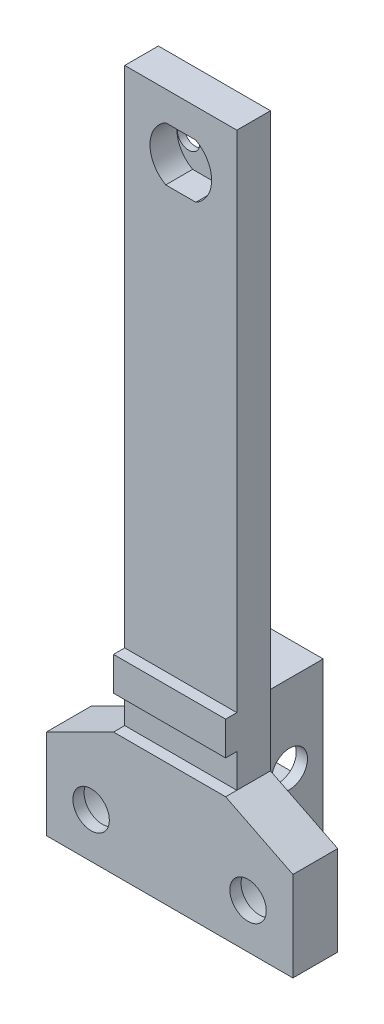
ISO-10303-21;
HEADER;
FILE_DESCRIPTION(('STEP AP214'),'2;1');
FILE_NAME('part.step','',(''),(''),'','','');
FILE_SCHEMA(('AUTOMOTIVE_DESIGN { 1 0 10303 214 1 1 1 1 }'));
ENDSEC;
DATA;
#1=APPLICATION_CONTEXT('core data for automotive mechanical design processes');
#2=APPLICATION_PROTOCOL_DEFINITION('international standard','automotive_design',2000,#1);
#3=PRODUCT_CONTEXT('',#1,'mechanical');
#4=PRODUCT('Part','Part','',(#3));
#5=PRODUCT_RELATED_PRODUCT_CATEGORY('part','',(#4));
#6=PRODUCT_DEFINITION_FORMATION('','',#4);
#7=PRODUCT_DEFINITION_CONTEXT('part definition',#1,'design');
#8=PRODUCT_DEFINITION('design','',#6,#7);
#9=PRODUCT_DEFINITION_SHAPE('','',#8);
#10=(LENGTH_UNIT() NAMED_UNIT(*) SI_UNIT(.MILLI.,.METRE.));
#11=(NAMED_UNIT(*) PLANE_ANGLE_UNIT() SI_UNIT($,.RADIAN.));
#12=(NAMED_UNIT(*) SI_UNIT($,.STERADIAN.) SOLID_ANGLE_UNIT());
#13=UNCERTAINTY_MEASURE_WITH_UNIT(LENGTH_MEASURE(1.E-05),#10,'distance_accuracy_value','');
#14=(GEOMETRIC_REPRESENTATION_CONTEXT(3) GLOBAL_UNCERTAINTY_ASSIGNED_CONTEXT((#13)) GLOBAL_UNIT_ASSIGNED_CONTEXT((#10,
#11,#12)) REPRESENTATION_CONTEXT('',''));
#15=CARTESIAN_POINT('',(0.,0.,0.));
#16=DIRECTION('',(0.,0.,1.));
#17=DIRECTION('',(1.,0.,0.));
#18=AXIS2_PLACEMENT_3D('',#15,#16,#17);
#19=CARTESIAN_POINT('',(0.,0.,0.));
#20=DIRECTION('',(0.,0.,-1.));
#21=DIRECTION('',(-1.,0.,0.));
#22=AXIS2_PLACEMENT_3D('',#19,#20,#21);
#23=PLANE('',#22);
#24=DIRECTION('',(0.,1.,0.));
#25=VECTOR('',#24,1.);
#26=CARTESIAN_POINT('',(5.,-30.,0.));
#27=LINE('',#26,#25);
#28=CARTESIAN_POINT('',(5.,-21.,0.));
#29=VERTEX_POINT('',#28);
#30=CARTESIAN_POINT('',(5.,30.,0.));
#31=VERTEX_POINT('',#30);
#32=EDGE_CURVE('E422',#29,#31,#27,.T.);
#33=ORIENTED_EDGE('',*,*,#32,.F.);
#34=DIRECTION('',(0.894427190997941,-0.447213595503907,0.));
#35=VECTOR('',#34,1.);
#36=CARTESIAN_POINT('',(5.,-21.,0.));
#37=LINE('',#36,#35);
#38=CARTESIAN_POINT('',(10.9999999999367,-24.0000000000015,0.));
#39=VERTEX_POINT('',#38);
#40=EDGE_CURVE('E316',#29,#39,#37,.T.);
#41=ORIENTED_EDGE('',*,*,#40,.T.);
#42=DIRECTION('',(0.,-1.,0.));
#43=VECTOR('',#42,1.);
#44=CARTESIAN_POINT('',(10.9999999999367,-24.0000000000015,0.));
#45=LINE('',#44,#43);
#46=CARTESIAN_POINT('',(10.9999999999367,-32.,0.));
#47=VERTEX_POINT('',#46);
#48=EDGE_CURVE('E314',#39,#47,#45,.T.);
#49=ORIENTED_EDGE('',*,*,#48,.T.);
#50=DIRECTION('',(-1.,0.,0.));
#51=VECTOR('',#50,1.);
#52=CARTESIAN_POINT('',(10.9999999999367,-32.,0.));
#53=LINE('',#52,#51);
#54=CARTESIAN_POINT('',(-11.0000000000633,-32.,0.));
#55=VERTEX_POINT('',#54);
#56=EDGE_CURVE('E289',#47,#55,#53,.T.);
#57=ORIENTED_EDGE('',*,*,#56,.T.);
#58=DIRECTION('',(0.,1.,0.));
#59=VECTOR('',#58,1.);
#60=CARTESIAN_POINT('',(-11.0000000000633,-24.0000000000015,0.));
#61=LINE('',#60,#59);
#62=CARTESIAN_POINT('',(-11.0000000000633,-24.0000000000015,0.));
#63=VERTEX_POINT('',#62);
#64=EDGE_CURVE('E320',#55,#63,#61,.T.);
#65=ORIENTED_EDGE('',*,*,#64,.T.);
#66=DIRECTION('',(0.894427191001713,0.447213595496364,0.));
#67=VECTOR('',#66,1.);
#68=CARTESIAN_POINT('',(-5.,-21.,0.));
#69=LINE('',#68,#67);
#70=CARTESIAN_POINT('',(-5.,-21.,0.));
#71=VERTEX_POINT('',#70);
#72=EDGE_CURVE('E328',#63,#71,#69,.T.);
#73=ORIENTED_EDGE('',*,*,#72,.T.);
#74=DIRECTION('',(0.,-1.,0.));
#75=VECTOR('',#74,1.);
#76=CARTESIAN_POINT('',(-5.,-30.,0.));
#77=LINE('',#76,#75);
#78=CARTESIAN_POINT('',(-5.,30.,0.));
#79=VERTEX_POINT('',#78);
#80=EDGE_CURVE('E435',#79,#71,#77,.T.);
#81=ORIENTED_EDGE('',*,*,#80,.F.);
#82=DIRECTION('',(-1.,0.,0.));
#83=VECTOR('',#82,1.);
#84=CARTESIAN_POINT('',(-5.,30.,0.));
#85=LINE('',#84,#83);
#86=EDGE_CURVE('E433',#31,#79,#85,.T.);
#87=ORIENTED_EDGE('',*,*,#86,.F.);
#88=EDGE_LOOP('',(#33,#41,#49,#57,#65,#73,#81,#87));
#89=FACE_BOUND('',#88,.T.);
#90=CARTESIAN_POINT('',(1.7,24.9,0.));
#91=DIRECTION('',(0.,0.,-1.));
#92=DIRECTION('',(-1.,0.,0.));
#93=AXIS2_PLACEMENT_3D('',#90,#91,#92);
#94=CIRCLE('',#93,1.);
#95=CARTESIAN_POINT('',(0.699999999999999,24.9,0.));
#96=VERTEX_POINT('',#95);
#97=EDGE_CURVE('E344',#96,#96,#94,.T.);
#98=ORIENTED_EDGE('',*,*,#97,.F.);
#99=EDGE_LOOP('',(#98));
#100=FACE_BOUND('',#99,.T.);
#101=CARTESIAN_POINT('',(-1.69999239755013,24.9,0.));
#102=DIRECTION('',(0.,0.,-1.));
#103=DIRECTION('',(-1.,0.,0.));
#104=AXIS2_PLACEMENT_3D('',#101,#102,#103);
#105=CIRCLE('',#104,1.);
#106=CARTESIAN_POINT('',(-2.69999239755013,24.9,0.));
#107=VERTEX_POINT('',#106);
#108=EDGE_CURVE('E349',#107,#107,#105,.T.);
#109=ORIENTED_EDGE('',*,*,#108,.F.);
#110=EDGE_LOOP('',(#109));
#111=FACE_BOUND('',#110,.T.);
#112=CARTESIAN_POINT('',(6.99999999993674,-28.0000000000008,0.));
#113=DIRECTION('',(0.,0.,-1.));
#114=DIRECTION('',(-1.,0.,0.));
#115=AXIS2_PLACEMENT_3D('',#112,#113,#114);
#116=CIRCLE('',#115,2.99999999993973);
#117=CARTESIAN_POINT('',(3.99999999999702,-28.0000000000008,0.));
#118=VERTEX_POINT('',#117);
#119=EDGE_CURVE('E293',#118,#118,#116,.T.);
#120=ORIENTED_EDGE('',*,*,#119,.F.);
#121=EDGE_LOOP('',(#120));
#122=FACE_BOUND('',#121,.T.);
#123=CARTESIAN_POINT('',(-7.00000000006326,-28.0000000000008,0.));
#124=DIRECTION('',(0.,0.,-1.));
#125=DIRECTION('',(-1.,0.,0.));
#126=AXIS2_PLACEMENT_3D('',#123,#124,#125);
#127=CIRCLE('',#126,2.99999999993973);
#128=CARTESIAN_POINT('',(-10.000000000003,-28.0000000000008,0.));
#129=VERTEX_POINT('',#128);
#130=EDGE_CURVE('E290',#129,#129,#127,.T.);
#131=ORIENTED_EDGE('',*,*,#130,.F.);
#132=EDGE_LOOP('',(#131));
#133=FACE_BOUND('',#132,.T.);
#134=DIRECTION('',(1.,0.,0.));
#135=VECTOR('',#134,1.);
#136=CARTESIAN_POINT('',(3.7,-16.0000000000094,0.));
#137=LINE('',#136,#135);
#138=CARTESIAN_POINT('',(-3.7,-16.0000000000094,0.));
#139=VERTEX_POINT('',#138);
#140=CARTESIAN_POINT('',(3.7,-16.0000000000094,0.));
#141=VERTEX_POINT('',#140);
#142=EDGE_CURVE('E266',#139,#141,#137,.T.);
#143=ORIENTED_EDGE('',*,*,#142,.F.);
#144=DIRECTION('',(0.,1.,0.));
#145=VECTOR('',#144,1.);
#146=CARTESIAN_POINT('',(-3.7,-30.,0.));
#147=LINE('',#146,#145);
#148=CARTESIAN_POINT('',(-3.7,-30.,0.));
#149=VERTEX_POINT('',#148);
#150=EDGE_CURVE('E229',#149,#139,#147,.T.);
#151=ORIENTED_EDGE('',*,*,#150,.F.);
#152=DIRECTION('',(-1.,0.,0.));
#153=VECTOR('',#152,1.);
#154=CARTESIAN_POINT('',(3.7,-30.,0.));
#155=LINE('',#154,#153);
#156=CARTESIAN_POINT('',(3.7,-30.,0.));
#157=VERTEX_POINT('',#156);
#158=EDGE_CURVE('E257',#157,#149,#155,.T.);
#159=ORIENTED_EDGE('',*,*,#158,.F.);
#160=DIRECTION('',(0.,-1.,0.));
#161=VECTOR('',#160,1.);
#162=CARTESIAN_POINT('',(3.7,-30.,0.));
#163=LINE('',#162,#161);
#164=EDGE_CURVE('E268',#141,#157,#163,.T.);
#165=ORIENTED_EDGE('',*,*,#164,.F.);
#166=EDGE_LOOP('',(#143,#151,#159,#165));
#167=FACE_BOUND('',#166,.T.);
#168=ADVANCED_FACE('F41',(#89,#100,#111,#122,#133,#167),#23,.T.);
#169=CARTESIAN_POINT('',(-5.,-30.,3.));
#170=DIRECTION('',(1.,0.,0.));
#171=DIRECTION('',(0.,0.,-1.));
#172=AXIS2_PLACEMENT_3D('',#169,#170,#171);
#173=PLANE('',#172);
#174=DIRECTION('',(0.,0.,-1.));
#175=VECTOR('',#174,1.);
#176=CARTESIAN_POINT('',(-5.,-21.,4.));
#177=LINE('',#176,#175);
#178=CARTESIAN_POINT('',(-5.,-21.,3.));
#179=VERTEX_POINT('',#178);
#180=EDGE_CURVE('E50',#179,#71,#177,.T.);
#181=ORIENTED_EDGE('',*,*,#180,.F.);
#182=DIRECTION('',(0.,-1.,0.));
#183=VECTOR('',#182,1.);
#184=CARTESIAN_POINT('',(-5.,-30.,3.));
#185=LINE('',#184,#183);
#186=CARTESIAN_POINT('',(-5.,-18.,3.));
#187=VERTEX_POINT('',#186);
#188=EDGE_CURVE('E428',#187,#179,#185,.T.);
#189=ORIENTED_EDGE('',*,*,#188,.F.);
#190=DIRECTION('',(0.,0.,-1.));
#191=VECTOR('',#190,1.);
#192=CARTESIAN_POINT('',(-5.,-18.,4.));
#193=LINE('',#192,#191);
#194=CARTESIAN_POINT('',(-5.,-18.,4.));
#195=VERTEX_POINT('',#194);
#196=EDGE_CURVE('E378',#195,#187,#193,.T.);
#197=ORIENTED_EDGE('',*,*,#196,.F.);
#198=DIRECTION('',(0.,-1.,0.));
#199=VECTOR('',#198,1.);
#200=CARTESIAN_POINT('',(-5.,-18.,4.));
#201=LINE('',#200,#199);
#202=CARTESIAN_POINT('',(-5.,-15.,4.));
#203=VERTEX_POINT('',#202);
#204=EDGE_CURVE('E401',#203,#195,#201,.T.);
#205=ORIENTED_EDGE('',*,*,#204,.F.);
#206=DIRECTION('',(0.,0.,-1.));
#207=VECTOR('',#206,1.);
#208=CARTESIAN_POINT('',(-5.,-15.,4.));
#209=LINE('',#208,#207);
#210=CARTESIAN_POINT('',(-5.,-15.,3.));
#211=VERTEX_POINT('',#210);
#212=EDGE_CURVE('E393',#203,#211,#209,.T.);
#213=ORIENTED_EDGE('',*,*,#212,.T.);
#214=CARTESIAN_POINT('',(-5.,30.,3.));
#215=VERTEX_POINT('',#214);
#216=EDGE_CURVE('E429',#215,#211,#185,.T.);
#217=ORIENTED_EDGE('',*,*,#216,.F.);
#218=DIRECTION('',(0.,0.,-1.));
#219=VECTOR('',#218,1.);
#220=CARTESIAN_POINT('',(-5.,30.,3.));
#221=LINE('',#220,#219);
#222=EDGE_CURVE('E431',#215,#79,#221,.T.);
#223=ORIENTED_EDGE('',*,*,#222,.T.);
#224=ORIENTED_EDGE('',*,*,#80,.T.);
#225=EDGE_LOOP('',(#181,#189,#197,#205,#213,#217,#223,#224));
#226=FACE_BOUND('',#225,.T.);
#227=ADVANCED_FACE('F497',(#226),#173,.F.);
#228=CARTESIAN_POINT('',(0.,0.,3.));
#229=DIRECTION('',(0.,0.,-1.));
#230=DIRECTION('',(-1.,0.,0.));
#231=AXIS2_PLACEMENT_3D('',#228,#229,#230);
#232=PLANE('',#231);
#233=DIRECTION('',(1.,0.,0.));
#234=VECTOR('',#233,1.);
#235=CARTESIAN_POINT('',(-5.,-18.,3.));
#236=LINE('',#235,#234);
#237=CARTESIAN_POINT('',(5.,-18.,3.));
#238=VERTEX_POINT('',#237);
#239=EDGE_CURVE('E400',#187,#238,#236,.T.);
#240=ORIENTED_EDGE('',*,*,#239,.F.);
#241=ORIENTED_EDGE('',*,*,#188,.T.);
#242=DIRECTION('',(-1.,0.,0.));
#243=VECTOR('',#242,1.);
#244=CARTESIAN_POINT('',(5.,-21.,3.));
#245=LINE('',#244,#243);
#246=CARTESIAN_POINT('',(5.,-21.,3.));
#247=VERTEX_POINT('',#246);
#248=EDGE_CURVE('E404',#247,#179,#245,.T.);
#249=ORIENTED_EDGE('',*,*,#248,.F.);
#250=DIRECTION('',(0.,1.,0.));
#251=VECTOR('',#250,1.);
#252=CARTESIAN_POINT('',(5.,-30.,3.));
#253=LINE('',#252,#251);
#254=EDGE_CURVE('E423',#247,#238,#253,.T.);
#255=ORIENTED_EDGE('',*,*,#254,.T.);
#256=EDGE_LOOP('',(#240,#241,#249,#255));
#257=FACE_BOUND('',#256,.T.);
#258=ADVANCED_FACE('F491',(#257),#232,.F.);
#259=DIRECTION('',(1.,0.,0.));
#260=VECTOR('',#259,1.);
#261=CARTESIAN_POINT('',(-1.34257215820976,22.6,3.));
#262=LINE('',#261,#260);
#263=CARTESIAN_POINT('',(-1.34257215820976,22.6,3.));
#264=VERTEX_POINT('',#263);
#265=CARTESIAN_POINT('',(1.34257215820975,22.6,3.));
#266=VERTEX_POINT('',#265);
#267=EDGE_CURVE('E368',#264,#266,#262,.T.);
#268=ORIENTED_EDGE('',*,*,#267,.F.);
#269=CARTESIAN_POINT('',(0.,25.,3.));
#270=DIRECTION('',(0.,0.,1.));
#271=DIRECTION('',(1.,0.,0.));
#272=AXIS2_PLACEMENT_3D('',#269,#270,#271);
#273=CIRCLE('',#272,2.75);
#274=CARTESIAN_POINT('',(-1.34257215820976,27.4,3.));
#275=VERTEX_POINT('',#274);
#276=EDGE_CURVE('E352',#275,#264,#273,.T.);
#277=ORIENTED_EDGE('',*,*,#276,.F.);
#278=DIRECTION('',(-1.,0.,0.));
#279=VECTOR('',#278,1.);
#280=CARTESIAN_POINT('',(-1.34257215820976,27.4,3.));
#281=LINE('',#280,#279);
#282=CARTESIAN_POINT('',(1.34257215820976,27.4,3.));
#283=VERTEX_POINT('',#282);
#284=EDGE_CURVE('E357',#283,#275,#281,.T.);
#285=ORIENTED_EDGE('',*,*,#284,.F.);
#286=CARTESIAN_POINT('',(0.,25.,3.));
#287=DIRECTION('',(0.,0.,1.));
#288=DIRECTION('',(1.,0.,0.));
#289=AXIS2_PLACEMENT_3D('',#286,#287,#288);
#290=CIRCLE('',#289,2.75);
#291=EDGE_CURVE('E371',#266,#283,#290,.T.);
#292=ORIENTED_EDGE('',*,*,#291,.F.);
#293=EDGE_LOOP('',(#268,#277,#285,#292));
#294=FACE_BOUND('',#293,.T.);
#295=DIRECTION('',(-1.,0.,0.));
#296=VECTOR('',#295,1.);
#297=CARTESIAN_POINT('',(-5.,-15.,3.));
#298=LINE('',#297,#296);
#299=CARTESIAN_POINT('',(5.,-15.,3.));
#300=VERTEX_POINT('',#299);
#301=EDGE_CURVE('E397',#300,#211,#298,.T.);
#302=ORIENTED_EDGE('',*,*,#301,.F.);
#303=CARTESIAN_POINT('',(5.,30.,3.));
#304=VERTEX_POINT('',#303);
#305=EDGE_CURVE('E426',#300,#304,#253,.T.);
#306=ORIENTED_EDGE('',*,*,#305,.T.);
#307=DIRECTION('',(-1.,0.,0.));
#308=VECTOR('',#307,1.);
#309=CARTESIAN_POINT('',(-5.,30.,3.));
#310=LINE('',#309,#308);
#311=EDGE_CURVE('E425',#304,#215,#310,.T.);
#312=ORIENTED_EDGE('',*,*,#311,.T.);
#313=ORIENTED_EDGE('',*,*,#216,.T.);
#314=EDGE_LOOP('',(#302,#306,#312,#313));
#315=FACE_BOUND('',#314,.T.);
#316=ADVANCED_FACE('F653',(#294,#315),#232,.F.);
#317=CARTESIAN_POINT('',(5.,-30.,3.));
#318=DIRECTION('',(-1.,0.,0.));
#319=DIRECTION('',(0.,0.,1.));
#320=AXIS2_PLACEMENT_3D('',#317,#318,#319);
#321=PLANE('',#320);
#322=ORIENTED_EDGE('',*,*,#254,.F.);
#323=DIRECTION('',(0.,0.,-1.));
#324=VECTOR('',#323,1.);
#325=CARTESIAN_POINT('',(5.,-21.,4.));
#326=LINE('',#325,#324);
#327=EDGE_CURVE('E11',#247,#29,#326,.T.);
#328=ORIENTED_EDGE('',*,*,#327,.T.);
#329=ORIENTED_EDGE('',*,*,#32,.T.);
#330=DIRECTION('',(0.,0.,-1.));
#331=VECTOR('',#330,1.);
#332=CARTESIAN_POINT('',(5.,30.,3.));
#333=LINE('',#332,#331);
#334=EDGE_CURVE('E338',#304,#31,#333,.T.);
#335=ORIENTED_EDGE('',*,*,#334,.F.);
#336=ORIENTED_EDGE('',*,*,#305,.F.);
#337=DIRECTION('',(0.,0.,-1.));
#338=VECTOR('',#337,1.);
#339=CARTESIAN_POINT('',(5.,-15.,4.));
#340=LINE('',#339,#338);
#341=CARTESIAN_POINT('',(5.,-15.,4.));
#342=VERTEX_POINT('',#341);
#343=EDGE_CURVE('E390',#342,#300,#340,.T.);
#344=ORIENTED_EDGE('',*,*,#343,.F.);
#345=DIRECTION('',(0.,1.,0.));
#346=VECTOR('',#345,1.);
#347=CARTESIAN_POINT('',(5.,-18.,4.));
#348=LINE('',#347,#346);
#349=CARTESIAN_POINT('',(5.,-18.,4.));
#350=VERTEX_POINT('',#349);
#351=EDGE_CURVE('E406',#350,#342,#348,.T.);
#352=ORIENTED_EDGE('',*,*,#351,.F.);
#353=DIRECTION('',(0.,0.,-1.));
#354=VECTOR('',#353,1.);
#355=CARTESIAN_POINT('',(5.,-18.,4.));
#356=LINE('',#355,#354);
#357=EDGE_CURVE('E387',#350,#238,#356,.T.);
#358=ORIENTED_EDGE('',*,*,#357,.T.);
#359=EDGE_LOOP('',(#322,#328,#329,#335,#336,#344,#352,#358));
#360=FACE_BOUND('',#359,.T.);
#361=ADVANCED_FACE('F43',(#360),#321,.F.);
#362=CARTESIAN_POINT('',(-5.,30.,3.));
#363=DIRECTION('',(0.,-1.,0.));
#364=DIRECTION('',(0.,0.,-1.));
#365=AXIS2_PLACEMENT_3D('',#362,#363,#364);
#366=PLANE('',#365);
#367=ORIENTED_EDGE('',*,*,#86,.T.);
#368=ORIENTED_EDGE('',*,*,#222,.F.);
#369=ORIENTED_EDGE('',*,*,#311,.F.);
#370=ORIENTED_EDGE('',*,*,#334,.T.);
#371=EDGE_LOOP('',(#367,#368,#369,#370));
#372=FACE_BOUND('',#371,.T.);
#373=ADVANCED_FACE('F502',(#372),#366,.F.);
#374=CARTESIAN_POINT('',(5.,-21.,4.));
#375=DIRECTION('',(0.,-1.,0.));
#376=DIRECTION('',(0.,0.,-1.));
#377=AXIS2_PLACEMENT_3D('',#374,#375,#376);
#378=PLANE('',#377);
#379=ORIENTED_EDGE('',*,*,#248,.T.);
#380=DIRECTION('',(0.,0.,-1.));
#381=VECTOR('',#380,1.);
#382=CARTESIAN_POINT('',(-5.,-21.,4.));
#383=LINE('',#382,#381);
#384=CARTESIAN_POINT('',(-5.,-21.,4.));
#385=VERTEX_POINT('',#384);
#386=EDGE_CURVE('E414',#385,#179,#383,.T.);
#387=ORIENTED_EDGE('',*,*,#386,.F.);
#388=DIRECTION('',(-1.,0.,0.));
#389=VECTOR('',#388,1.);
#390=CARTESIAN_POINT('',(5.,-21.,4.));
#391=LINE('',#390,#389);
#392=CARTESIAN_POINT('',(5.,-21.,4.));
#393=VERTEX_POINT('',#392);
#394=EDGE_CURVE('E412',#393,#385,#391,.T.);
#395=ORIENTED_EDGE('',*,*,#394,.F.);
#396=DIRECTION('',(0.,0.,-1.));
#397=VECTOR('',#396,1.);
#398=CARTESIAN_POINT('',(5.,-21.,4.));
#399=LINE('',#398,#397);
#400=EDGE_CURVE('E419',#393,#247,#399,.T.);
#401=ORIENTED_EDGE('',*,*,#400,.T.);
#402=EDGE_LOOP('',(#379,#387,#395,#401));
#403=FACE_BOUND('',#402,.T.);
#404=ADVANCED_FACE('F452',(#403),#378,.F.);
#405=CARTESIAN_POINT('',(0.,0.,4.));
#406=DIRECTION('',(0.,0.,1.));
#407=DIRECTION('',(1.,0.,0.));
#408=AXIS2_PLACEMENT_3D('',#405,#406,#407);
#409=PLANE('',#408);
#410=CARTESIAN_POINT('',(-7.00000000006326,-28.0000000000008,4.));
#411=DIRECTION('',(0.,0.,1.));
#412=DIRECTION('',(1.,0.,0.));
#413=AXIS2_PLACEMENT_3D('',#410,#411,#412);
#414=CIRCLE('',#413,1.62499999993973);
#415=CARTESIAN_POINT('',(-5.37500000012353,-28.0000000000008,4.));
#416=VERTEX_POINT('',#415);
#417=EDGE_CURVE('E299',#416,#416,#414,.T.);
#418=ORIENTED_EDGE('',*,*,#417,.F.);
#419=EDGE_LOOP('',(#418));
#420=FACE_BOUND('',#419,.T.);
#421=CARTESIAN_POINT('',(6.99999999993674,-28.0000000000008,4.));
#422=DIRECTION('',(0.,0.,1.));
#423=DIRECTION('',(1.,0.,0.));
#424=AXIS2_PLACEMENT_3D('',#421,#422,#423);
#425=CIRCLE('',#424,1.62499999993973);
#426=CARTESIAN_POINT('',(8.62499999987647,-28.0000000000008,4.));
#427=VERTEX_POINT('',#426);
#428=EDGE_CURVE('E283',#427,#427,#425,.T.);
#429=ORIENTED_EDGE('',*,*,#428,.F.);
#430=EDGE_LOOP('',(#429));
#431=FACE_BOUND('',#430,.T.);
#432=DIRECTION('',(0.,1.,0.));
#433=VECTOR('',#432,1.);
#434=CARTESIAN_POINT('',(-11.0000000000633,-24.0000000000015,4.));
#435=LINE('',#434,#433);
#436=CARTESIAN_POINT('',(-11.0000000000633,-32.,4.));
#437=VERTEX_POINT('',#436);
#438=CARTESIAN_POINT('',(-11.0000000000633,-24.0000000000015,4.));
#439=VERTEX_POINT('',#438);
#440=EDGE_CURVE('E324',#437,#439,#435,.T.);
#441=ORIENTED_EDGE('',*,*,#440,.F.);
#442=DIRECTION('',(-1.,0.,0.));
#443=VECTOR('',#442,1.);
#444=CARTESIAN_POINT('',(10.9999999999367,-32.,4.));
#445=LINE('',#444,#443);
#446=CARTESIAN_POINT('',(10.9999999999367,-32.,4.));
#447=VERTEX_POINT('',#446);
#448=EDGE_CURVE('E300',#447,#437,#445,.T.);
#449=ORIENTED_EDGE('',*,*,#448,.F.);
#450=DIRECTION('',(0.,-1.,0.));
#451=VECTOR('',#450,1.);
#452=CARTESIAN_POINT('',(10.9999999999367,-24.0000000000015,4.));
#453=LINE('',#452,#451);
#454=CARTESIAN_POINT('',(10.9999999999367,-24.0000000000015,4.));
#455=VERTEX_POINT('',#454);
#456=EDGE_CURVE('E313',#455,#447,#453,.T.);
#457=ORIENTED_EDGE('',*,*,#456,.F.);
#458=DIRECTION('',(0.894427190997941,-0.447213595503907,0.));
#459=VECTOR('',#458,1.);
#460=CARTESIAN_POINT('',(5.,-21.,4.));
#461=LINE('',#460,#459);
#462=EDGE_CURVE('E317',#393,#455,#461,.T.);
#463=ORIENTED_EDGE('',*,*,#462,.F.);
#464=ORIENTED_EDGE('',*,*,#394,.T.);
#465=DIRECTION('',(0.894427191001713,0.447213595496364,0.));
#466=VECTOR('',#465,1.);
#467=CARTESIAN_POINT('',(-5.,-21.,4.));
#468=LINE('',#467,#466);
#469=EDGE_CURVE('E327',#439,#385,#468,.T.);
#470=ORIENTED_EDGE('',*,*,#469,.F.);
#471=EDGE_LOOP('',(#441,#449,#457,#463,#464,#470));
#472=FACE_BOUND('',#471,.T.);
#473=ADVANCED_FACE('F448',(#420,#431,#472),#409,.T.);
#474=CARTESIAN_POINT('',(-5.,-18.,4.));
#475=DIRECTION('',(0.,1.,0.));
#476=DIRECTION('',(0.,0.,1.));
#477=AXIS2_PLACEMENT_3D('',#474,#475,#476);
#478=PLANE('',#477);
#479=ORIENTED_EDGE('',*,*,#239,.T.);
#480=ORIENTED_EDGE('',*,*,#357,.F.);
#481=DIRECTION('',(1.,0.,0.));
#482=VECTOR('',#481,1.);
#483=CARTESIAN_POINT('',(-5.,-18.,4.));
#484=LINE('',#483,#482);
#485=EDGE_CURVE('E408',#195,#350,#484,.T.);
#486=ORIENTED_EDGE('',*,*,#485,.F.);
#487=ORIENTED_EDGE('',*,*,#196,.T.);
#488=EDGE_LOOP('',(#479,#480,#486,#487));
#489=FACE_BOUND('',#488,.T.);
#490=ADVANCED_FACE('F451',(#489),#478,.F.);
#491=CARTESIAN_POINT('',(-5.,-15.,4.));
#492=DIRECTION('',(0.,-1.,0.));
#493=DIRECTION('',(1.,0.,0.));
#494=AXIS2_PLACEMENT_3D('',#491,#492,#493);
#495=PLANE('',#494);
#496=ORIENTED_EDGE('',*,*,#301,.T.);
#497=ORIENTED_EDGE('',*,*,#212,.F.);
#498=DIRECTION('',(-1.,0.,0.));
#499=VECTOR('',#498,1.);
#500=CARTESIAN_POINT('',(-5.,-15.,4.));
#501=LINE('',#500,#499);
#502=EDGE_CURVE('E396',#342,#203,#501,.T.);
#503=ORIENTED_EDGE('',*,*,#502,.F.);
#504=ORIENTED_EDGE('',*,*,#343,.T.);
#505=EDGE_LOOP('',(#496,#497,#503,#504));
#506=FACE_BOUND('',#505,.T.);
#507=ADVANCED_FACE('F508',(#506),#495,.F.);
#508=CARTESIAN_POINT('',(0.,0.,4.));
#509=DIRECTION('',(0.,0.,-1.));
#510=DIRECTION('',(-1.,0.,0.));
#511=AXIS2_PLACEMENT_3D('',#508,#509,#510);
#512=PLANE('',#511);
#513=ORIENTED_EDGE('',*,*,#204,.T.);
#514=ORIENTED_EDGE('',*,*,#485,.T.);
#515=ORIENTED_EDGE('',*,*,#351,.T.);
#516=ORIENTED_EDGE('',*,*,#502,.T.);
#517=EDGE_LOOP('',(#513,#514,#515,#516));
#518=FACE_BOUND('',#517,.T.);
#519=ADVANCED_FACE('F511',(#518),#512,.F.);
#520=CARTESIAN_POINT('',(0.,25.,0.6));
#521=DIRECTION('',(0.,0.,1.));
#522=DIRECTION('',(1.,0.,0.));
#523=AXIS2_PLACEMENT_3D('',#520,#521,#522);
#524=CYLINDRICAL_SURFACE('',#523,2.75);
#525=ORIENTED_EDGE('',*,*,#276,.T.);
#526=DIRECTION('',(0.,0.,1.));
#527=VECTOR('',#526,1.);
#528=CARTESIAN_POINT('',(-1.34257215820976,22.6,0.6));
#529=LINE('',#528,#527);
#530=CARTESIAN_POINT('',(-1.34257215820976,22.6,0.6));
#531=VERTEX_POINT('',#530);
#532=EDGE_CURVE('E366',#531,#264,#529,.T.);
#533=ORIENTED_EDGE('',*,*,#532,.F.);
#534=CARTESIAN_POINT('',(0.,25.,0.6));
#535=DIRECTION('',(0.,0.,1.));
#536=DIRECTION('',(1.,0.,0.));
#537=AXIS2_PLACEMENT_3D('',#534,#535,#536);
#538=CIRCLE('',#537,2.75);
#539=CARTESIAN_POINT('',(-1.34257215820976,27.4,0.6));
#540=VERTEX_POINT('',#539);
#541=EDGE_CURVE('E353',#540,#531,#538,.T.);
#542=ORIENTED_EDGE('',*,*,#541,.F.);
#543=DIRECTION('',(0.,0.,1.));
#544=VECTOR('',#543,1.);
#545=CARTESIAN_POINT('',(-1.34257215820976,27.4,0.6));
#546=LINE('',#545,#544);
#547=EDGE_CURVE('E376',#540,#275,#546,.T.);
#548=ORIENTED_EDGE('',*,*,#547,.T.);
#549=EDGE_LOOP('',(#525,#533,#542,#548));
#550=FACE_BOUND('',#549,.T.);
#551=ADVANCED_FACE('F513',(#550),#524,.F.);
#552=CARTESIAN_POINT('',(-1.34257215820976,27.4,0.6));
#553=DIRECTION('',(0.,1.,0.));
#554=DIRECTION('',(0.,0.,1.));
#555=AXIS2_PLACEMENT_3D('',#552,#553,#554);
#556=PLANE('',#555);
#557=ORIENTED_EDGE('',*,*,#284,.T.);
#558=ORIENTED_EDGE('',*,*,#547,.F.);
#559=DIRECTION('',(-1.,0.,0.));
#560=VECTOR('',#559,1.);
#561=CARTESIAN_POINT('',(-1.34257215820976,27.4,0.6));
#562=LINE('',#561,#560);
#563=CARTESIAN_POINT('',(1.34257215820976,27.4,0.6));
#564=VERTEX_POINT('',#563);
#565=EDGE_CURVE('E363',#564,#540,#562,.T.);
#566=ORIENTED_EDGE('',*,*,#565,.F.);
#567=DIRECTION('',(0.,0.,1.));
#568=VECTOR('',#567,1.);
#569=CARTESIAN_POINT('',(1.34257215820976,27.4,0.6));
#570=LINE('',#569,#568);
#571=EDGE_CURVE('E379',#564,#283,#570,.T.);
#572=ORIENTED_EDGE('',*,*,#571,.T.);
#573=EDGE_LOOP('',(#557,#558,#566,#572));
#574=FACE_BOUND('',#573,.T.);
#575=ADVANCED_FACE('F519',(#574),#556,.F.);
#576=CARTESIAN_POINT('',(0.,25.,0.6));
#577=DIRECTION('',(0.,0.,1.));
#578=DIRECTION('',(1.,0.,0.));
#579=AXIS2_PLACEMENT_3D('',#576,#577,#578);
#580=CYLINDRICAL_SURFACE('',#579,2.75);
#581=ORIENTED_EDGE('',*,*,#291,.T.);
#582=ORIENTED_EDGE('',*,*,#571,.F.);
#583=CARTESIAN_POINT('',(0.,25.,0.6));
#584=DIRECTION('',(0.,0.,1.));
#585=DIRECTION('',(1.,0.,0.));
#586=AXIS2_PLACEMENT_3D('',#583,#584,#585);
#587=CIRCLE('',#586,2.75);
#588=CARTESIAN_POINT('',(1.34257215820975,22.6,0.6));
#589=VERTEX_POINT('',#588);
#590=EDGE_CURVE('E360',#589,#564,#587,.T.);
#591=ORIENTED_EDGE('',*,*,#590,.F.);
#592=DIRECTION('',(0.,0.,1.));
#593=VECTOR('',#592,1.);
#594=CARTESIAN_POINT('',(1.34257215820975,22.6,0.6));
#595=LINE('',#594,#593);
#596=EDGE_CURVE('E381',#589,#266,#595,.T.);
#597=ORIENTED_EDGE('',*,*,#596,.T.);
#598=EDGE_LOOP('',(#581,#582,#591,#597));
#599=FACE_BOUND('',#598,.T.);
#600=ADVANCED_FACE('F622',(#599),#580,.F.);
#601=CARTESIAN_POINT('',(-1.34257215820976,22.6,0.6));
#602=DIRECTION('',(0.,-1.,0.));
#603=DIRECTION('',(0.,0.,-1.));
#604=AXIS2_PLACEMENT_3D('',#601,#602,#603);
#605=PLANE('',#604);
#606=ORIENTED_EDGE('',*,*,#267,.T.);
#607=ORIENTED_EDGE('',*,*,#596,.F.);
#608=DIRECTION('',(1.,0.,0.));
#609=VECTOR('',#608,1.);
#610=CARTESIAN_POINT('',(-1.34257215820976,22.6,0.6));
#611=LINE('',#610,#609);
#612=EDGE_CURVE('E356',#531,#589,#611,.T.);
#613=ORIENTED_EDGE('',*,*,#612,.F.);
#614=ORIENTED_EDGE('',*,*,#532,.T.);
#615=EDGE_LOOP('',(#606,#607,#613,#614));
#616=FACE_BOUND('',#615,.T.);
#617=ADVANCED_FACE('F618',(#616),#605,.F.);
#618=CARTESIAN_POINT('',(0.,25.,0.6));
#619=DIRECTION('',(0.,0.,1.));
#620=DIRECTION('',(1.,0.,0.));
#621=AXIS2_PLACEMENT_3D('',#618,#619,#620);
#622=PLANE('',#621);
#623=CARTESIAN_POINT('',(-1.69999239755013,24.9,0.6));
#624=DIRECTION('',(0.,0.,1.));
#625=DIRECTION('',(1.,0.,0.));
#626=AXIS2_PLACEMENT_3D('',#623,#624,#625);
#627=CIRCLE('',#626,1.);
#628=CARTESIAN_POINT('',(-0.699992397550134,24.9,0.6));
#629=VERTEX_POINT('',#628);
#630=EDGE_CURVE('E341',#629,#629,#627,.T.);
#631=ORIENTED_EDGE('',*,*,#630,.F.);
#632=EDGE_LOOP('',(#631));
#633=FACE_BOUND('',#632,.T.);
#634=CARTESIAN_POINT('',(1.7,24.9,0.6));
#635=DIRECTION('',(0.,0.,1.));
#636=DIRECTION('',(1.,0.,0.));
#637=AXIS2_PLACEMENT_3D('',#634,#635,#636);
#638=CIRCLE('',#637,1.);
#639=CARTESIAN_POINT('',(2.7,24.9,0.6));
#640=VERTEX_POINT('',#639);
#641=EDGE_CURVE('E340',#640,#640,#638,.T.);
#642=ORIENTED_EDGE('',*,*,#641,.F.);
#643=EDGE_LOOP('',(#642));
#644=FACE_BOUND('',#643,.T.);
#645=ORIENTED_EDGE('',*,*,#541,.T.);
#646=ORIENTED_EDGE('',*,*,#612,.T.);
#647=ORIENTED_EDGE('',*,*,#590,.T.);
#648=ORIENTED_EDGE('',*,*,#565,.T.);
#649=EDGE_LOOP('',(#645,#646,#647,#648));
#650=FACE_BOUND('',#649,.T.);
#651=ADVANCED_FACE('F614',(#633,#644,#650),#622,.T.);
#652=CARTESIAN_POINT('',(1.7,24.9,-2.4));
#653=DIRECTION('',(0.,0.,1.));
#654=DIRECTION('',(1.,0.,0.));
#655=AXIS2_PLACEMENT_3D('',#652,#653,#654);
#656=CYLINDRICAL_SURFACE('',#655,1.);
#657=ORIENTED_EDGE('',*,*,#97,.T.);
#658=EDGE_LOOP('',(#657));
#659=FACE_BOUND('',#658,.T.);
#660=ORIENTED_EDGE('',*,*,#641,.T.);
#661=EDGE_LOOP('',(#660));
#662=FACE_BOUND('',#661,.T.);
#663=ADVANCED_FACE('F610',(#659,#662),#656,.F.);
#664=CARTESIAN_POINT('',(-1.69999239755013,24.9,-2.4));
#665=DIRECTION('',(0.,0.,1.));
#666=DIRECTION('',(1.,0.,0.));
#667=AXIS2_PLACEMENT_3D('',#664,#665,#666);
#668=CYLINDRICAL_SURFACE('',#667,1.);
#669=ORIENTED_EDGE('',*,*,#108,.T.);
#670=EDGE_LOOP('',(#669));
#671=FACE_BOUND('',#670,.T.);
#672=ORIENTED_EDGE('',*,*,#630,.T.);
#673=EDGE_LOOP('',(#672));
#674=FACE_BOUND('',#673,.T.);
#675=ADVANCED_FACE('F605',(#671,#674),#668,.F.);
#676=CARTESIAN_POINT('',(-5.,-21.,4.));
#677=DIRECTION('',(-0.447213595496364,0.894427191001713,0.));
#678=DIRECTION('',(-0.894427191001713,-0.447213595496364,0.));
#679=AXIS2_PLACEMENT_3D('',#676,#677,#678);
#680=PLANE('',#679);
#681=ORIENTED_EDGE('',*,*,#72,.F.);
#682=DIRECTION('',(0.,0.,-1.));
#683=VECTOR('',#682,1.);
#684=CARTESIAN_POINT('',(-11.0000000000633,-24.0000000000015,4.));
#685=LINE('',#684,#683);
#686=EDGE_CURVE('E331',#439,#63,#685,.T.);
#687=ORIENTED_EDGE('',*,*,#686,.F.);
#688=ORIENTED_EDGE('',*,*,#469,.T.);
#689=ORIENTED_EDGE('',*,*,#386,.T.);
#690=ORIENTED_EDGE('',*,*,#180,.T.);
#691=EDGE_LOOP('',(#681,#687,#688,#689,#690));
#692=FACE_BOUND('',#691,.T.);
#693=ADVANCED_FACE('F478',(#692),#680,.T.);
#694=CARTESIAN_POINT('',(-11.0000000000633,-24.0000000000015,4.));
#695=DIRECTION('',(-1.,0.,0.));
#696=DIRECTION('',(0.,0.,1.));
#697=AXIS2_PLACEMENT_3D('',#694,#695,#696);
#698=PLANE('',#697);
#699=ORIENTED_EDGE('',*,*,#64,.F.);
#700=DIRECTION('',(0.,0.,-1.));
#701=VECTOR('',#700,1.);
#702=CARTESIAN_POINT('',(-11.0000000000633,-32.,4.));
#703=LINE('',#702,#701);
#704=EDGE_CURVE('E306',#437,#55,#703,.T.);
#705=ORIENTED_EDGE('',*,*,#704,.F.);
#706=ORIENTED_EDGE('',*,*,#440,.T.);
#707=ORIENTED_EDGE('',*,*,#686,.T.);
#708=EDGE_LOOP('',(#699,#705,#706,#707));
#709=FACE_BOUND('',#708,.T.);
#710=ADVANCED_FACE('F461',(#709),#698,.T.);
#711=CARTESIAN_POINT('',(10.9999999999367,-24.0000000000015,4.));
#712=DIRECTION('',(1.,0.,0.));
#713=DIRECTION('',(0.,0.,-1.));
#714=AXIS2_PLACEMENT_3D('',#711,#712,#713);
#715=PLANE('',#714);
#716=ORIENTED_EDGE('',*,*,#48,.F.);
#717=DIRECTION('',(0.,0.,-1.));
#718=VECTOR('',#717,1.);
#719=CARTESIAN_POINT('',(10.9999999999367,-24.0000000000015,4.));
#720=LINE('',#719,#718);
#721=EDGE_CURVE('E309',#455,#39,#720,.T.);
#722=ORIENTED_EDGE('',*,*,#721,.F.);
#723=ORIENTED_EDGE('',*,*,#456,.T.);
#724=DIRECTION('',(0.,0.,-1.));
#725=VECTOR('',#724,1.);
#726=CARTESIAN_POINT('',(10.9999999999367,-32.,4.));
#727=LINE('',#726,#725);
#728=EDGE_CURVE('E303',#447,#47,#727,.T.);
#729=ORIENTED_EDGE('',*,*,#728,.T.);
#730=EDGE_LOOP('',(#716,#722,#723,#729));
#731=FACE_BOUND('',#730,.T.);
#732=ADVANCED_FACE('F468',(#731),#715,.T.);
#733=CARTESIAN_POINT('',(5.,-21.,4.));
#734=DIRECTION('',(0.447213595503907,0.894427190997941,0.));
#735=DIRECTION('',(-0.894427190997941,0.447213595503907,0.));
#736=AXIS2_PLACEMENT_3D('',#733,#734,#735);
#737=PLANE('',#736);
#738=ORIENTED_EDGE('',*,*,#40,.F.);
#739=ORIENTED_EDGE('',*,*,#327,.F.);
#740=ORIENTED_EDGE('',*,*,#400,.F.);
#741=ORIENTED_EDGE('',*,*,#462,.T.);
#742=ORIENTED_EDGE('',*,*,#721,.T.);
#743=EDGE_LOOP('',(#738,#739,#740,#741,#742));
#744=FACE_BOUND('',#743,.T.);
#745=ADVANCED_FACE('F472',(#744),#737,.T.);
#746=CARTESIAN_POINT('',(10.9999999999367,-32.,4.));
#747=DIRECTION('',(0.,-1.,0.));
#748=DIRECTION('',(1.,0.,0.));
#749=AXIS2_PLACEMENT_3D('',#746,#747,#748);
#750=PLANE('',#749);
#751=ORIENTED_EDGE('',*,*,#56,.F.);
#752=ORIENTED_EDGE('',*,*,#728,.F.);
#753=ORIENTED_EDGE('',*,*,#448,.T.);
#754=ORIENTED_EDGE('',*,*,#704,.T.);
#755=EDGE_LOOP('',(#751,#752,#753,#754));
#756=FACE_BOUND('',#755,.T.);
#757=ADVANCED_FACE('F465',(#756),#750,.T.);
#758=CARTESIAN_POINT('',(6.99999999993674,-28.0000000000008,3.));
#759=DIRECTION('',(0.,0.,-1.));
#760=DIRECTION('',(-1.,0.,0.));
#761=AXIS2_PLACEMENT_3D('',#758,#759,#760);
#762=CYLINDRICAL_SURFACE('',#761,2.99999999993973);
#763=CARTESIAN_POINT('',(6.99999999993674,-28.0000000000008,3.));
#764=DIRECTION('',(0.,0.,-1.));
#765=DIRECTION('',(-1.,0.,0.));
#766=AXIS2_PLACEMENT_3D('',#763,#764,#765);
#767=CIRCLE('',#766,2.99999999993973);
#768=CARTESIAN_POINT('',(3.99999999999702,-28.0000000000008,3.));
#769=VERTEX_POINT('',#768);
#770=EDGE_CURVE('E296',#769,#769,#767,.T.);
#771=ORIENTED_EDGE('',*,*,#770,.F.);
#772=EDGE_LOOP('',(#771));
#773=FACE_BOUND('',#772,.T.);
#774=ORIENTED_EDGE('',*,*,#119,.T.);
#775=EDGE_LOOP('',(#774));
#776=FACE_BOUND('',#775,.T.);
#777=ADVANCED_FACE('F590',(#773,#776),#762,.F.);
#778=CARTESIAN_POINT('',(6.99999999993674,-28.0000000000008,3.));
#779=DIRECTION('',(0.,0.,-1.));
#780=DIRECTION('',(-1.,0.,0.));
#781=AXIS2_PLACEMENT_3D('',#778,#779,#780);
#782=PLANE('',#781);
#783=CARTESIAN_POINT('',(6.99999999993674,-28.0000000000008,3.));
#784=DIRECTION('',(0.,0.,-1.));
#785=DIRECTION('',(-1.,0.,0.));
#786=AXIS2_PLACEMENT_3D('',#783,#784,#785);
#787=CIRCLE('',#786,1.62499999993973);
#788=CARTESIAN_POINT('',(5.37499999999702,-28.0000000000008,3.));
#789=VERTEX_POINT('',#788);
#790=EDGE_CURVE('E279',#789,#789,#787,.T.);
#791=ORIENTED_EDGE('',*,*,#790,.F.);
#792=EDGE_LOOP('',(#791));
#793=FACE_BOUND('',#792,.T.);
#794=ORIENTED_EDGE('',*,*,#770,.T.);
#795=EDGE_LOOP('',(#794));
#796=FACE_BOUND('',#795,.T.);
#797=ADVANCED_FACE('F588',(#793,#796),#782,.T.);
#798=CARTESIAN_POINT('',(-7.00000000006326,-28.0000000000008,3.));
#799=DIRECTION('',(0.,0.,-1.));
#800=DIRECTION('',(-1.,0.,0.));
#801=AXIS2_PLACEMENT_3D('',#798,#799,#800);
#802=CYLINDRICAL_SURFACE('',#801,2.99999999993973);
#803=CARTESIAN_POINT('',(-7.00000000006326,-28.0000000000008,3.));
#804=DIRECTION('',(0.,0.,-1.));
#805=DIRECTION('',(-1.,0.,0.));
#806=AXIS2_PLACEMENT_3D('',#803,#804,#805);
#807=CIRCLE('',#806,2.99999999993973);
#808=CARTESIAN_POINT('',(-10.000000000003,-28.0000000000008,3.));
#809=VERTEX_POINT('',#808);
#810=EDGE_CURVE('E286',#809,#809,#807,.T.);
#811=ORIENTED_EDGE('',*,*,#810,.F.);
#812=EDGE_LOOP('',(#811));
#813=FACE_BOUND('',#812,.T.);
#814=ORIENTED_EDGE('',*,*,#130,.T.);
#815=EDGE_LOOP('',(#814));
#816=FACE_BOUND('',#815,.T.);
#817=ADVANCED_FACE('F584',(#813,#816),#802,.F.);
#818=CARTESIAN_POINT('',(-7.00000000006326,-28.0000000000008,3.));
#819=DIRECTION('',(0.,0.,-1.));
#820=DIRECTION('',(-1.,0.,0.));
#821=AXIS2_PLACEMENT_3D('',#818,#819,#820);
#822=PLANE('',#821);
#823=CARTESIAN_POINT('',(-7.00000000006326,-28.0000000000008,3.));
#824=DIRECTION('',(0.,0.,-1.));
#825=DIRECTION('',(-1.,0.,0.));
#826=AXIS2_PLACEMENT_3D('',#823,#824,#825);
#827=CIRCLE('',#826,1.62499999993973);
#828=CARTESIAN_POINT('',(-8.62500000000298,-28.0000000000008,3.));
#829=VERTEX_POINT('',#828);
#830=EDGE_CURVE('E280',#829,#829,#827,.T.);
#831=ORIENTED_EDGE('',*,*,#830,.F.);
#832=EDGE_LOOP('',(#831));
#833=FACE_BOUND('',#832,.T.);
#834=ORIENTED_EDGE('',*,*,#810,.T.);
#835=EDGE_LOOP('',(#834));
#836=FACE_BOUND('',#835,.T.);
#837=ADVANCED_FACE('F580',(#833,#836),#822,.T.);
#838=CARTESIAN_POINT('',(6.99999999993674,-28.0000000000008,7.));
#839=DIRECTION('',(0.,0.,-1.));
#840=DIRECTION('',(-1.,0.,0.));
#841=AXIS2_PLACEMENT_3D('',#838,#839,#840);
#842=CYLINDRICAL_SURFACE('',#841,1.62499999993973);
#843=ORIENTED_EDGE('',*,*,#428,.T.);
#844=EDGE_LOOP('',(#843));
#845=FACE_BOUND('',#844,.T.);
#846=ORIENTED_EDGE('',*,*,#790,.T.);
#847=EDGE_LOOP('',(#846));
#848=FACE_BOUND('',#847,.T.);
#849=ADVANCED_FACE('F577',(#845,#848),#842,.F.);
#850=CARTESIAN_POINT('',(-7.00000000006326,-28.0000000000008,7.));
#851=DIRECTION('',(0.,0.,-1.));
#852=DIRECTION('',(-1.,0.,0.));
#853=AXIS2_PLACEMENT_3D('',#850,#851,#852);
#854=CYLINDRICAL_SURFACE('',#853,1.62499999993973);
#855=ORIENTED_EDGE('',*,*,#417,.T.);
#856=EDGE_LOOP('',(#855));
#857=FACE_BOUND('',#856,.T.);
#858=ORIENTED_EDGE('',*,*,#830,.T.);
#859=EDGE_LOOP('',(#858));
#860=FACE_BOUND('',#859,.T.);
#861=ADVANCED_FACE('F445',(#857,#860),#854,.F.);
#862=CARTESIAN_POINT('',(0.,0.,-6.));
#863=DIRECTION('',(0.,0.,1.));
#864=DIRECTION('',(1.,0.,0.));
#865=AXIS2_PLACEMENT_3D('',#862,#863,#864);
#866=PLANE('',#865);
#867=DIRECTION('',(0.,1.,0.));
#868=VECTOR('',#867,1.);
#869=CARTESIAN_POINT('',(-3.7,-30.,-6.));
#870=LINE('',#869,#868);
#871=CARTESIAN_POINT('',(-3.7,-30.,-6.));
#872=VERTEX_POINT('',#871);
#873=CARTESIAN_POINT('',(-3.7,-16.0000000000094,-6.));
#874=VERTEX_POINT('',#873);
#875=EDGE_CURVE('E253',#872,#874,#870,.T.);
#876=ORIENTED_EDGE('',*,*,#875,.T.);
#877=DIRECTION('',(1.,0.,0.));
#878=VECTOR('',#877,1.);
#879=CARTESIAN_POINT('',(3.7,-16.0000000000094,-6.));
#880=LINE('',#879,#878);
#881=CARTESIAN_POINT('',(3.7,-16.0000000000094,-6.));
#882=VERTEX_POINT('',#881);
#883=EDGE_CURVE('E256',#874,#882,#880,.T.);
#884=ORIENTED_EDGE('',*,*,#883,.T.);
#885=DIRECTION('',(0.,-1.,0.));
#886=VECTOR('',#885,1.);
#887=CARTESIAN_POINT('',(3.7,-30.,-6.));
#888=LINE('',#887,#886);
#889=CARTESIAN_POINT('',(3.7,-30.,-6.));
#890=VERTEX_POINT('',#889);
#891=EDGE_CURVE('E259',#882,#890,#888,.T.);
#892=ORIENTED_EDGE('',*,*,#891,.T.);
#893=DIRECTION('',(-1.,0.,0.));
#894=VECTOR('',#893,1.);
#895=CARTESIAN_POINT('',(3.7,-30.,-6.));
#896=LINE('',#895,#894);
#897=EDGE_CURVE('E261',#890,#872,#896,.T.);
#898=ORIENTED_EDGE('',*,*,#897,.T.);
#899=EDGE_LOOP('',(#876,#884,#892,#898));
#900=FACE_BOUND('',#899,.T.);
#901=DIRECTION('',(0.,-1.,0.));
#902=VECTOR('',#901,1.);
#903=CARTESIAN_POINT('',(2.7,-19.9000000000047,-6.));
#904=LINE('',#903,#902);
#905=CARTESIAN_POINT('',(2.7,-19.9000000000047,-6.));
#906=VERTEX_POINT('',#905);
#907=CARTESIAN_POINT('',(2.7,-26.1000000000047,-6.));
#908=VERTEX_POINT('',#907);
#909=EDGE_CURVE('E212',#906,#908,#904,.T.);
#910=ORIENTED_EDGE('',*,*,#909,.F.);
#911=DIRECTION('',(1.,0.,0.));
#912=VECTOR('',#911,1.);
#913=CARTESIAN_POINT('',(2.7,-19.9000000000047,-6.));
#914=LINE('',#913,#912);
#915=CARTESIAN_POINT('',(-0.5,-19.9000000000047,-6.));
#916=VERTEX_POINT('',#915);
#917=EDGE_CURVE('E237',#916,#906,#914,.T.);
#918=ORIENTED_EDGE('',*,*,#917,.F.);
#919=DIRECTION('',(0.,1.,0.));
#920=VECTOR('',#919,1.);
#921=CARTESIAN_POINT('',(-0.5,-19.9000000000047,-6.));
#922=LINE('',#921,#920);
#923=CARTESIAN_POINT('',(-0.500000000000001,-26.1000000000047,-6.));
#924=VERTEX_POINT('',#923);
#925=EDGE_CURVE('E235',#924,#916,#922,.T.);
#926=ORIENTED_EDGE('',*,*,#925,.F.);
#927=DIRECTION('',(-1.,0.,0.));
#928=VECTOR('',#927,1.);
#929=CARTESIAN_POINT('',(2.7,-26.1000000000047,-6.));
#930=LINE('',#929,#928);
#931=EDGE_CURVE('E221',#908,#924,#930,.T.);
#932=ORIENTED_EDGE('',*,*,#931,.F.);
#933=EDGE_LOOP('',(#910,#918,#926,#932));
#934=FACE_BOUND('',#933,.T.);
#935=ADVANCED_FACE('F233',(#900,#934),#866,.F.);
#936=CARTESIAN_POINT('',(-3.7,-30.,-6.));
#937=DIRECTION('',(1.,0.,0.));
#938=DIRECTION('',(0.,0.,-1.));
#939=AXIS2_PLACEMENT_3D('',#936,#937,#938);
#940=PLANE('',#939);
#941=CARTESIAN_POINT('',(-3.7,-23.0000000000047,-3.));
#942=DIRECTION('',(1.,0.,0.));
#943=DIRECTION('',(0.,0.,-1.));
#944=AXIS2_PLACEMENT_3D('',#941,#942,#943);
#945=CIRCLE('',#944,1.6);
#946=CARTESIAN_POINT('',(-3.7,-23.0000000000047,-4.6));
#947=VERTEX_POINT('',#946);
#948=EDGE_CURVE('E243',#947,#947,#945,.T.);
#949=ORIENTED_EDGE('',*,*,#948,.T.);
#950=EDGE_LOOP('',(#949));
#951=FACE_BOUND('',#950,.T.);
#952=ORIENTED_EDGE('',*,*,#150,.T.);
#953=DIRECTION('',(0.,0.,1.));
#954=VECTOR('',#953,1.);
#955=CARTESIAN_POINT('',(-3.7,-16.0000000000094,-6.));
#956=LINE('',#955,#954);
#957=EDGE_CURVE('E277',#874,#139,#956,.T.);
#958=ORIENTED_EDGE('',*,*,#957,.F.);
#959=ORIENTED_EDGE('',*,*,#875,.F.);
#960=DIRECTION('',(0.,0.,1.));
#961=VECTOR('',#960,1.);
#962=CARTESIAN_POINT('',(-3.7,-30.,-6.));
#963=LINE('',#962,#961);
#964=EDGE_CURVE('E263',#872,#149,#963,.T.);
#965=ORIENTED_EDGE('',*,*,#964,.T.);
#966=EDGE_LOOP('',(#952,#958,#959,#965));
#967=FACE_BOUND('',#966,.T.);
#968=ADVANCED_FACE('F561',(#951,#967),#940,.F.);
#969=CARTESIAN_POINT('',(3.7,-16.0000000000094,-6.));
#970=DIRECTION('',(0.,-1.,0.));
#971=DIRECTION('',(0.,0.,-1.));
#972=AXIS2_PLACEMENT_3D('',#969,#970,#971);
#973=PLANE('',#972);
#974=ORIENTED_EDGE('',*,*,#142,.T.);
#975=DIRECTION('',(0.,0.,1.));
#976=VECTOR('',#975,1.);
#977=CARTESIAN_POINT('',(3.7,-16.0000000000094,-6.));
#978=LINE('',#977,#976);
#979=EDGE_CURVE('E274',#882,#141,#978,.T.);
#980=ORIENTED_EDGE('',*,*,#979,.F.);
#981=ORIENTED_EDGE('',*,*,#883,.F.);
#982=ORIENTED_EDGE('',*,*,#957,.T.);
#983=EDGE_LOOP('',(#974,#980,#981,#982));
#984=FACE_BOUND('',#983,.T.);
#985=ADVANCED_FACE('F568',(#984),#973,.F.);
#986=CARTESIAN_POINT('',(3.7,-30.,-6.));
#987=DIRECTION('',(-1.,0.,0.));
#988=DIRECTION('',(0.,0.,1.));
#989=AXIS2_PLACEMENT_3D('',#986,#987,#988);
#990=PLANE('',#989);
#991=CARTESIAN_POINT('',(3.7,-23.0000000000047,-3.));
#992=DIRECTION('',(1.,0.,0.));
#993=DIRECTION('',(0.,0.,-1.));
#994=AXIS2_PLACEMENT_3D('',#991,#992,#993);
#995=CIRCLE('',#994,1.6);
#996=CARTESIAN_POINT('',(3.7,-23.0000000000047,-4.6));
#997=VERTEX_POINT('',#996);
#998=EDGE_CURVE('E908',#997,#997,#995,.T.);
#999=ORIENTED_EDGE('',*,*,#998,.F.);
#1000=EDGE_LOOP('',(#999));
#1001=FACE_BOUND('',#1000,.T.);
#1002=ORIENTED_EDGE('',*,*,#164,.T.);
#1003=DIRECTION('',(0.,0.,1.));
#1004=VECTOR('',#1003,1.);
#1005=CARTESIAN_POINT('',(3.7,-30.,-6.));
#1006=LINE('',#1005,#1004);
#1007=EDGE_CURVE('E58',#890,#157,#1006,.T.);
#1008=ORIENTED_EDGE('',*,*,#1007,.F.);
#1009=ORIENTED_EDGE('',*,*,#891,.F.);
#1010=ORIENTED_EDGE('',*,*,#979,.T.);
#1011=EDGE_LOOP('',(#1002,#1008,#1009,#1010));
#1012=FACE_BOUND('',#1011,.T.);
#1013=ADVANCED_FACE('F565',(#1001,#1012),#990,.F.);
#1014=CARTESIAN_POINT('',(3.7,-30.,-6.));
#1015=DIRECTION('',(0.,1.,0.));
#1016=DIRECTION('',(0.,0.,1.));
#1017=AXIS2_PLACEMENT_3D('',#1014,#1015,#1016);
#1018=PLANE('',#1017);
#1019=ORIENTED_EDGE('',*,*,#158,.T.);
#1020=ORIENTED_EDGE('',*,*,#964,.F.);
#1021=ORIENTED_EDGE('',*,*,#897,.F.);
#1022=ORIENTED_EDGE('',*,*,#1007,.T.);
#1023=EDGE_LOOP('',(#1019,#1020,#1021,#1022));
#1024=FACE_BOUND('',#1023,.T.);
#1025=ADVANCED_FACE('F558',(#1024),#1018,.F.);
#1026=CARTESIAN_POINT('',(2.7,-19.9000000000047,-6.));
#1027=DIRECTION('',(-1.,0.,0.));
#1028=DIRECTION('',(0.,-1.,0.));
#1029=AXIS2_PLACEMENT_3D('',#1026,#1027,#1028);
#1030=PLANE('',#1029);
#1031=CARTESIAN_POINT('',(2.7,-23.0000000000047,-3.));
#1032=DIRECTION('',(-1.,0.,0.));
#1033=DIRECTION('',(0.,-1.,0.));
#1034=AXIS2_PLACEMENT_3D('',#1031,#1032,#1033);
#1035=CIRCLE('',#1034,1.6);
#1036=CARTESIAN_POINT('',(2.7,-24.6000000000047,-3.));
#1037=VERTEX_POINT('',#1036);
#1038=EDGE_CURVE('E905',#1037,#1037,#1035,.T.);
#1039=ORIENTED_EDGE('',*,*,#1038,.F.);
#1040=EDGE_LOOP('',(#1039));
#1041=FACE_BOUND('',#1040,.T.);
#1042=DIRECTION('',(0.,-1.,0.));
#1043=VECTOR('',#1042,1.);
#1044=CARTESIAN_POINT('',(2.7,-19.9000000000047,0.));
#1045=LINE('',#1044,#1043);
#1046=CARTESIAN_POINT('',(2.7,-19.9000000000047,0.));
#1047=VERTEX_POINT('',#1046);
#1048=CARTESIAN_POINT('',(2.7,-26.1000000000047,0.));
#1049=VERTEX_POINT('',#1048);
#1050=EDGE_CURVE('E66',#1047,#1049,#1045,.T.);
#1051=ORIENTED_EDGE('',*,*,#1050,.F.);
#1052=DIRECTION('',(0.,0.,1.));
#1053=VECTOR('',#1052,1.);
#1054=CARTESIAN_POINT('',(2.7,-19.9000000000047,-6.));
#1055=LINE('',#1054,#1053);
#1056=EDGE_CURVE('E217',#906,#1047,#1055,.T.);
#1057=ORIENTED_EDGE('',*,*,#1056,.F.);
#1058=ORIENTED_EDGE('',*,*,#909,.T.);
#1059=DIRECTION('',(0.,0.,1.));
#1060=VECTOR('',#1059,1.);
#1061=CARTESIAN_POINT('',(2.7,-26.1000000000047,-6.));
#1062=LINE('',#1061,#1060);
#1063=EDGE_CURVE('E215',#908,#1049,#1062,.T.);
#1064=ORIENTED_EDGE('',*,*,#1063,.T.);
#1065=EDGE_LOOP('',(#1051,#1057,#1058,#1064));
#1066=FACE_BOUND('',#1065,.T.);
#1067=ADVANCED_FACE('F214',(#1041,#1066),#1030,.T.);
#1068=CARTESIAN_POINT('',(2.7,-26.1000000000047,-6.));
#1069=DIRECTION('',(0.,1.,0.));
#1070=DIRECTION('',(0.,0.,1.));
#1071=AXIS2_PLACEMENT_3D('',#1068,#1069,#1070);
#1072=PLANE('',#1071);
#1073=DIRECTION('',(-1.,0.,0.));
#1074=VECTOR('',#1073,1.);
#1075=CARTESIAN_POINT('',(2.7,-26.1000000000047,0.));
#1076=LINE('',#1075,#1074);
#1077=CARTESIAN_POINT('',(-0.500000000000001,-26.1000000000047,0.));
#1078=VERTEX_POINT('',#1077);
#1079=EDGE_CURVE('E228',#1049,#1078,#1076,.T.);
#1080=ORIENTED_EDGE('',*,*,#1079,.F.);
#1081=ORIENTED_EDGE('',*,*,#1063,.F.);
#1082=ORIENTED_EDGE('',*,*,#931,.T.);
#1083=DIRECTION('',(0.,0.,1.));
#1084=VECTOR('',#1083,1.);
#1085=CARTESIAN_POINT('',(-0.500000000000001,-26.1000000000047,-6.));
#1086=LINE('',#1085,#1084);
#1087=EDGE_CURVE('E230',#924,#1078,#1086,.T.);
#1088=ORIENTED_EDGE('',*,*,#1087,.T.);
#1089=EDGE_LOOP('',(#1080,#1081,#1082,#1088));
#1090=FACE_BOUND('',#1089,.T.);
#1091=ADVANCED_FACE('F225',(#1090),#1072,.T.);
#1092=CARTESIAN_POINT('',(-0.5,-19.9000000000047,-6.));
#1093=DIRECTION('',(1.,0.,0.));
#1094=DIRECTION('',(0.,1.,0.));
#1095=AXIS2_PLACEMENT_3D('',#1092,#1093,#1094);
#1096=PLANE('',#1095);
#1097=CARTESIAN_POINT('',(-0.500000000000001,-23.0000000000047,-3.));
#1098=DIRECTION('',(1.,0.,0.));
#1099=DIRECTION('',(0.,1.,0.));
#1100=AXIS2_PLACEMENT_3D('',#1097,#1098,#1099);
#1101=CIRCLE('',#1100,1.6);
#1102=CARTESIAN_POINT('',(-0.500000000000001,-21.4000000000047,-3.));
#1103=VERTEX_POINT('',#1102);
#1104=EDGE_CURVE('E45',#1103,#1103,#1101,.T.);
#1105=ORIENTED_EDGE('',*,*,#1104,.F.);
#1106=EDGE_LOOP('',(#1105));
#1107=FACE_BOUND('',#1106,.T.);
#1108=DIRECTION('',(0.,1.,0.));
#1109=VECTOR('',#1108,1.);
#1110=CARTESIAN_POINT('',(-0.5,-19.9000000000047,0.));
#1111=LINE('',#1110,#1109);
#1112=CARTESIAN_POINT('',(-0.5,-19.9000000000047,0.));
#1113=VERTEX_POINT('',#1112);
#1114=EDGE_CURVE('E245',#1078,#1113,#1111,.T.);
#1115=ORIENTED_EDGE('',*,*,#1114,.F.);
#1116=ORIENTED_EDGE('',*,*,#1087,.F.);
#1117=ORIENTED_EDGE('',*,*,#925,.T.);
#1118=DIRECTION('',(0.,0.,1.));
#1119=VECTOR('',#1118,1.);
#1120=CARTESIAN_POINT('',(-0.5,-19.9000000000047,-6.));
#1121=LINE('',#1120,#1119);
#1122=EDGE_CURVE('E249',#916,#1113,#1121,.T.);
#1123=ORIENTED_EDGE('',*,*,#1122,.T.);
#1124=EDGE_LOOP('',(#1115,#1116,#1117,#1123));
#1125=FACE_BOUND('',#1124,.T.);
#1126=ADVANCED_FACE('F544',(#1107,#1125),#1096,.T.);
#1127=CARTESIAN_POINT('',(2.7,-19.9000000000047,-6.));
#1128=DIRECTION('',(0.,-1.,0.));
#1129=DIRECTION('',(0.,0.,-1.));
#1130=AXIS2_PLACEMENT_3D('',#1127,#1128,#1129);
#1131=PLANE('',#1130);
#1132=DIRECTION('',(1.,0.,0.));
#1133=VECTOR('',#1132,1.);
#1134=CARTESIAN_POINT('',(2.7,-19.9000000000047,0.));
#1135=LINE('',#1134,#1133);
#1136=EDGE_CURVE('E222',#1113,#1047,#1135,.T.);
#1137=ORIENTED_EDGE('',*,*,#1136,.F.);
#1138=ORIENTED_EDGE('',*,*,#1122,.F.);
#1139=ORIENTED_EDGE('',*,*,#917,.T.);
#1140=ORIENTED_EDGE('',*,*,#1056,.T.);
#1141=EDGE_LOOP('',(#1137,#1138,#1139,#1140));
#1142=FACE_BOUND('',#1141,.T.);
#1143=ADVANCED_FACE('F535',(#1142),#1131,.T.);
#1144=ORIENTED_EDGE('',*,*,#1050,.T.);
#1145=ORIENTED_EDGE('',*,*,#1079,.T.);
#1146=ORIENTED_EDGE('',*,*,#1114,.T.);
#1147=ORIENTED_EDGE('',*,*,#1136,.T.);
#1148=EDGE_LOOP('',(#1144,#1145,#1146,#1147));
#1149=FACE_BOUND('',#1148,.T.);
#1150=ADVANCED_FACE('F525',(#1149),#23,.T.);
#1151=CARTESIAN_POINT('',(-4.3,-23.0000000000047,-3.));
#1152=DIRECTION('',(1.,0.,0.));
#1153=DIRECTION('',(0.,0.,-1.));
#1154=AXIS2_PLACEMENT_3D('',#1151,#1152,#1153);
#1155=CYLINDRICAL_SURFACE('',#1154,1.6);
#1156=ORIENTED_EDGE('',*,*,#1104,.T.);
#1157=EDGE_LOOP('',(#1156));
#1158=FACE_BOUND('',#1157,.T.);
#1159=ORIENTED_EDGE('',*,*,#948,.F.);
#1160=EDGE_LOOP('',(#1159));
#1161=FACE_BOUND('',#1160,.T.);
#1162=ADVANCED_FACE('F534',(#1158,#1161),#1155,.F.);
#1163=ORIENTED_EDGE('',*,*,#1038,.T.);
#1164=EDGE_LOOP('',(#1163));
#1165=FACE_BOUND('',#1164,.T.);
#1166=ORIENTED_EDGE('',*,*,#998,.T.);
#1167=EDGE_LOOP('',(#1166));
#1168=FACE_BOUND('',#1167,.T.);
#1169=ADVANCED_FACE('F541',(#1165,#1168),#1155,.F.);
#1170=CLOSED_SHELL('',(#168,#227,#258,#316,#361,#373,#404,#473,#490,#507,#519,#551,#575,#600,
#617,#651,#663,#675,#693,#710,#732,#745,#757,#777,#797,#817,#837,#849,#861,#935,#968,#985,#1013,
#1025,#1067,#1091,#1126,#1143,#1150,#1162,#1169));
#1171=MANIFOLD_SOLID_BREP('B2',#1170);
#1172=ADVANCED_BREP_SHAPE_REPRESENTATION('',(#18,#1171),#14);
#1173=SHAPE_DEFINITION_REPRESENTATION(#9,#1172);
ENDSEC;
END-ISO-10303-21;
